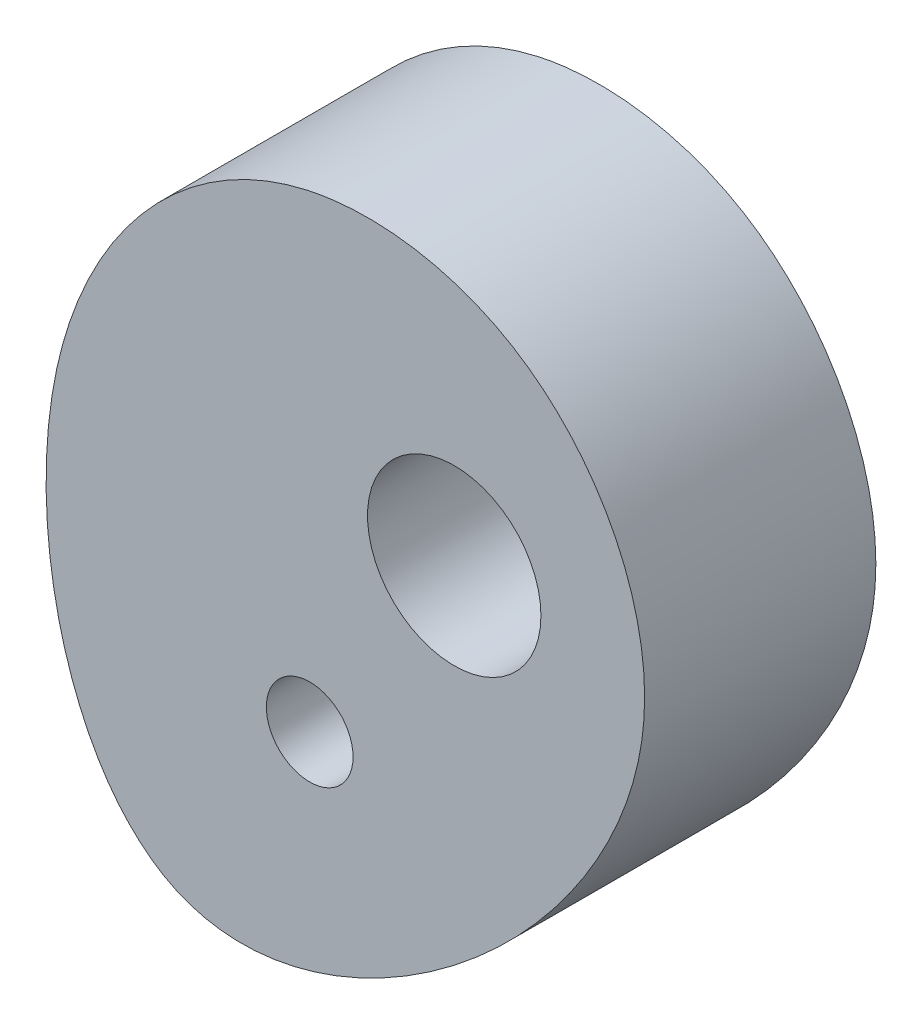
ISO-10303-21;
HEADER;
FILE_DESCRIPTION(('STEP AP214'),'2;1');
FILE_NAME('part.step','',(''),(''),'','','');
FILE_SCHEMA(('AUTOMOTIVE_DESIGN { 1 0 10303 214 1 1 1 1 }'));
ENDSEC;
DATA;
#1=APPLICATION_CONTEXT('core data for automotive mechanical design processes');
#2=APPLICATION_PROTOCOL_DEFINITION('international standard','automotive_design',2000,#1);
#3=PRODUCT_CONTEXT('',#1,'mechanical');
#4=PRODUCT('Part','Part','',(#3));
#5=PRODUCT_RELATED_PRODUCT_CATEGORY('part','',(#4));
#6=PRODUCT_DEFINITION_FORMATION('','',#4);
#7=PRODUCT_DEFINITION_CONTEXT('part definition',#1,'design');
#8=PRODUCT_DEFINITION('design','',#6,#7);
#9=PRODUCT_DEFINITION_SHAPE('','',#8);
#10=(LENGTH_UNIT() NAMED_UNIT(*) SI_UNIT(.MILLI.,.METRE.));
#11=(NAMED_UNIT(*) PLANE_ANGLE_UNIT() SI_UNIT($,.RADIAN.));
#12=(NAMED_UNIT(*) SI_UNIT($,.STERADIAN.) SOLID_ANGLE_UNIT());
#13=UNCERTAINTY_MEASURE_WITH_UNIT(LENGTH_MEASURE(1.E-05),#10,'distance_accuracy_value','');
#14=(GEOMETRIC_REPRESENTATION_CONTEXT(3) GLOBAL_UNCERTAINTY_ASSIGNED_CONTEXT((#13)) GLOBAL_UNIT_ASSIGNED_CONTEXT((#10,
#11,#12)) REPRESENTATION_CONTEXT('',''));
#15=CARTESIAN_POINT('',(0.,0.,0.));
#16=DIRECTION('',(0.,0.,1.));
#17=DIRECTION('',(1.,0.,0.));
#18=AXIS2_PLACEMENT_3D('',#15,#16,#17);
#19=CARTESIAN_POINT('',(-4.60773028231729,-14.5188931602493,4.));
#20=DIRECTION('',(0.,0.,1.));
#21=DIRECTION('',(1.,0.,0.));
#22=AXIS2_PLACEMENT_3D('',#19,#20,#21);
#23=PLANE('',#22);
#24=CARTESIAN_POINT('',(-5.,-7.48331477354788,4.));
#25=DIRECTION('',(0.,0.,1.));
#26=DIRECTION('',(1.,0.,0.));
#27=AXIS2_PLACEMENT_3D('',#24,#25,#26);
#28=CIRCLE('',#27,1.5);
#29=CARTESIAN_POINT('',(-3.5,-7.48331477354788,4.));
#30=VERTEX_POINT('',#29);
#31=EDGE_CURVE('E61',#30,#30,#28,.T.);
#32=ORIENTED_EDGE('',*,*,#31,.F.);
#33=EDGE_LOOP('',(#32));
#34=FACE_BOUND('',#33,.T.);
#35=CARTESIAN_POINT('',(-5.09638440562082,8.70422857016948,4.));
#36=CARTESIAN_POINT('',(-9.33672720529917,7.76435354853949,4.));
#37=CARTESIAN_POINT('',(-16.3468739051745,-0.272266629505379,4.));
#38=CARTESIAN_POINT('',(-11.0334337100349,-22.4889447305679,4.));
#39=CARTESIAN_POINT('',(10.8145474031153,-5.10108881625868,4.));
#40=CARTESIAN_POINT('',(3.58977037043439,8.34917351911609,4.));
#41=CARTESIAN_POINT('',(-2.75322123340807,9.22359236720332,4.));
#42=CARTESIAN_POINT('',(-5.09638440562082,8.70422857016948,4.));
#43=B_SPLINE_CURVE_WITH_KNOTS('',3,(#35,#36,#37,#38,#39,#40,#41,#42),.UNSPECIFIED.,.T.,.F.,(4,1,
1,1,1,4),(0.,0.19808276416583,0.416362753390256,0.734962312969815,0.890541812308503,1.),.UNSPECIFIED.);
#44=CARTESIAN_POINT('',(-5.09638440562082,8.70422857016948,4.));
#45=VERTEX_POINT('',#44);
#46=EDGE_CURVE('E10',#45,#45,#43,.T.);
#47=ORIENTED_EDGE('',*,*,#46,.T.);
#48=EDGE_LOOP('',(#47));
#49=FACE_BOUND('',#48,.T.);
#50=CARTESIAN_POINT('',(0.,0.,4.));
#51=DIRECTION('',(0.,0.,1.));
#52=DIRECTION('',(1.,0.,0.));
#53=AXIS2_PLACEMENT_3D('',#50,#51,#52);
#54=CIRCLE('',#53,3.);
#55=CARTESIAN_POINT('',(3.,0.,4.));
#56=VERTEX_POINT('',#55);
#57=EDGE_CURVE('E44',#56,#56,#54,.T.);
#58=ORIENTED_EDGE('',*,*,#57,.F.);
#59=EDGE_LOOP('',(#58));
#60=FACE_BOUND('',#59,.T.);
#61=ADVANCED_FACE('F30',(#34,#49,#60),#23,.T.);
#62=CARTESIAN_POINT('',(-4.60773028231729,-14.5188931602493,-4.));
#63=DIRECTION('',(0.,0.,1.));
#64=DIRECTION('',(1.,0.,0.));
#65=AXIS2_PLACEMENT_3D('',#62,#63,#64);
#66=PLANE('',#65);
#67=CARTESIAN_POINT('',(-5.,-7.48331477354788,-4.));
#68=DIRECTION('',(0.,0.,1.));
#69=DIRECTION('',(1.,0.,0.));
#70=AXIS2_PLACEMENT_3D('',#67,#68,#69);
#71=CIRCLE('',#70,1.5);
#72=CARTESIAN_POINT('',(-3.5,-7.48331477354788,-4.));
#73=VERTEX_POINT('',#72);
#74=EDGE_CURVE('E58',#73,#73,#71,.T.);
#75=ORIENTED_EDGE('',*,*,#74,.T.);
#76=EDGE_LOOP('',(#75));
#77=FACE_BOUND('',#76,.T.);
#78=CARTESIAN_POINT('',(-5.09638440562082,8.70422857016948,-4.));
#79=CARTESIAN_POINT('',(-9.33672720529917,7.76435354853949,-4.));
#80=CARTESIAN_POINT('',(-16.3468739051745,-0.272266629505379,-4.));
#81=CARTESIAN_POINT('',(-11.0334337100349,-22.4889447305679,-4.));
#82=CARTESIAN_POINT('',(10.8145474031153,-5.10108881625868,-4.));
#83=CARTESIAN_POINT('',(3.58977037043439,8.34917351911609,-4.));
#84=CARTESIAN_POINT('',(-2.75322123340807,9.22359236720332,-4.));
#85=CARTESIAN_POINT('',(-5.09638440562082,8.70422857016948,-4.));
#86=B_SPLINE_CURVE_WITH_KNOTS('',3,(#78,#79,#80,#81,#82,#83,#84,#85),.UNSPECIFIED.,.T.,.F.,(4,1,
1,1,1,4),(0.,0.19808276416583,0.416362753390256,0.734962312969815,0.890541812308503,1.),.UNSPECIFIED.);
#87=CARTESIAN_POINT('',(-5.09638440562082,8.70422857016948,-4.));
#88=VERTEX_POINT('',#87);
#89=EDGE_CURVE('E40',#88,#88,#86,.T.);
#90=ORIENTED_EDGE('',*,*,#89,.F.);
#91=EDGE_LOOP('',(#90));
#92=FACE_BOUND('',#91,.T.);
#93=CARTESIAN_POINT('',(0.,0.,-4.));
#94=DIRECTION('',(0.,0.,1.));
#95=DIRECTION('',(1.,0.,0.));
#96=AXIS2_PLACEMENT_3D('',#93,#94,#95);
#97=CIRCLE('',#96,3.);
#98=CARTESIAN_POINT('',(3.,0.,-4.));
#99=VERTEX_POINT('',#98);
#100=EDGE_CURVE('E48',#99,#99,#97,.T.);
#101=ORIENTED_EDGE('',*,*,#100,.T.);
#102=EDGE_LOOP('',(#101));
#103=FACE_BOUND('',#102,.T.);
#104=ADVANCED_FACE('F68',(#77,#92,#103),#66,.F.);
#105=DIRECTION('',(0.,0.,-1.));
#106=VECTOR('',#105,1.);
#107=SURFACE_OF_LINEAR_EXTRUSION('',#43,#106);
#108=ORIENTED_EDGE('',*,*,#46,.F.);
#109=EDGE_LOOP('',(#108));
#110=FACE_BOUND('',#109,.T.);
#111=ORIENTED_EDGE('',*,*,#89,.T.);
#112=EDGE_LOOP('',(#111));
#113=FACE_BOUND('',#112,.T.);
#114=ADVANCED_FACE('F32',(#110,#113),#107,.F.);
#115=CARTESIAN_POINT('',(0.,0.,4.));
#116=DIRECTION('',(0.,0.,-1.));
#117=DIRECTION('',(-1.,0.,0.));
#118=AXIS2_PLACEMENT_3D('',#115,#116,#117);
#119=CYLINDRICAL_SURFACE('',#118,3.);
#120=ORIENTED_EDGE('',*,*,#57,.T.);
#121=EDGE_LOOP('',(#120));
#122=FACE_BOUND('',#121,.T.);
#123=ORIENTED_EDGE('',*,*,#100,.F.);
#124=EDGE_LOOP('',(#123));
#125=FACE_BOUND('',#124,.T.);
#126=ADVANCED_FACE('F72',(#122,#125),#119,.F.);
#127=CARTESIAN_POINT('',(-5.,-7.48331477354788,-4.));
#128=DIRECTION('',(0.,0.,1.));
#129=DIRECTION('',(1.,0.,0.));
#130=AXIS2_PLACEMENT_3D('',#127,#128,#129);
#131=CYLINDRICAL_SURFACE('',#130,1.5);
#132=ORIENTED_EDGE('',*,*,#74,.F.);
#133=EDGE_LOOP('',(#132));
#134=FACE_BOUND('',#133,.T.);
#135=ORIENTED_EDGE('',*,*,#31,.T.);
#136=EDGE_LOOP('',(#135));
#137=FACE_BOUND('',#136,.T.);
#138=ADVANCED_FACE('F65',(#134,#137),#131,.F.);
#139=CLOSED_SHELL('',(#61,#104,#114,#126,#138));
#140=MANIFOLD_SOLID_BREP('B2',#139);
#141=ADVANCED_BREP_SHAPE_REPRESENTATION('',(#18,#140),#14);
#142=SHAPE_DEFINITION_REPRESENTATION(#9,#141);
ENDSEC;
END-ISO-10303-21;
